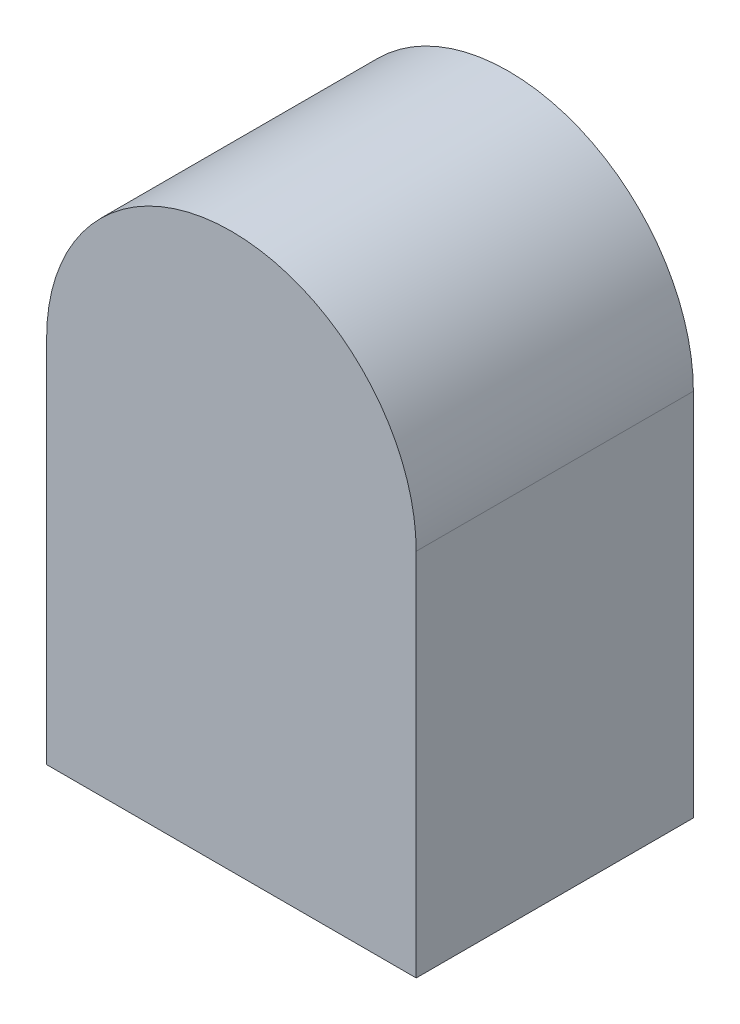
from build123d import *

# Parameters (mm, degrees)
EXTRUDE1_DEPTH = 38.1


with BuildPart() as part:
    # Sketch1 → Extrude1 (new body)
    with BuildSketch(Plane.XY):
        with BuildLine():
            Line((-25.4, 0), (-25.4, 50.8))
            ThreePointArc((-25.4, 50.8), (0, 76.2), (25.4, 50.8))
            Line((25.4, 50.8), (25.4, 0))
            Line((25.4, 0), (-25.4, 0))
        make_face()
    extrude(amount=-EXTRUDE1_DEPTH)


solid = part.part
